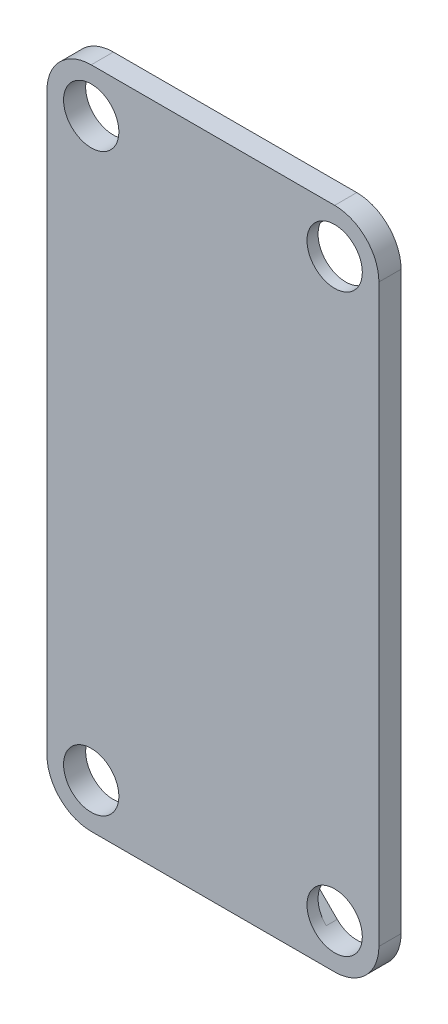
from build123d import *

# Parameters (mm, degrees)
ESQUISSE1_R             = 50
BOSS_EXTRU_1_DEPTH      = 40
ENL_V_MAT_EXTRU_2_DEPTH = 20


with BuildPart() as part:
    # Esquisse1 → Boss.-Extru.1 (new body)
    with BuildSketch(Plane.XY):
        with BuildLine():
            Line((-220, -600), (220, -600))
            ThreePointArc((220, -600), (276.568542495, -576.568542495), (300, -520))
            Line((300, -520), (300, 520))
            ThreePointArc((300, 520), (276.568542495, 576.568542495), (220, 600))
            Line((220, 600), (-220, 600))
            ThreePointArc((-220, 600), (-276.568542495, 576.568542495), (-300, 520))
            Line((-300, 520), (-300, -520))
            ThreePointArc((-300, -520), (-276.568542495, -576.568542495), (-220, -600))
        make_face()
        with Locations((-220, -520)):
            Circle(ESQUISSE1_R, mode=Mode.SUBTRACT)
        with Locations((220, -520)):
            Circle(ESQUISSE1_R, mode=Mode.SUBTRACT)
        with Locations((220, 520)):
            Circle(ESQUISSE1_R, mode=Mode.SUBTRACT)
        with Locations((-220, 520)):
            Circle(ESQUISSE1_R, mode=Mode.SUBTRACT)
    extrude(amount=BOSS_EXTRU_1_DEPTH)

    # Esquisse2 → Enl_v. mat.-Extru.2 (cut)
    with BuildSketch(Plane(origin=(0, 0, 0), x_dir=(-1, 0, 0), z_dir=(0, 0, -1))):
        with BuildLine():
            Line((-270, 520), (-270, -520))
            ThreePointArc((-270, -520), (-220, -470), (-170, -520))
            ThreePointArc((-170, -520), (-173.806023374, -539.134171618), (-184.644660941, -555.355339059))
            Line((-184.644660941, -555.355339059), (230, -140.710678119))
            Line((230, -140.710678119), (230, 135.717249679))
            Line((230, 135.717249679), (-174.091058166, 539.808307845))
            ThreePointArc((-174.091058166, 539.808307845), (-171.033444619, 530.113182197), (-170, 520))
            ThreePointArc((-170, 520), (-220, 470), (-270, 520))
        make_face()
    extrude(amount=-ENL_V_MAT_EXTRU_2_DEPTH, mode=Mode.SUBTRACT)


solid = part.part
